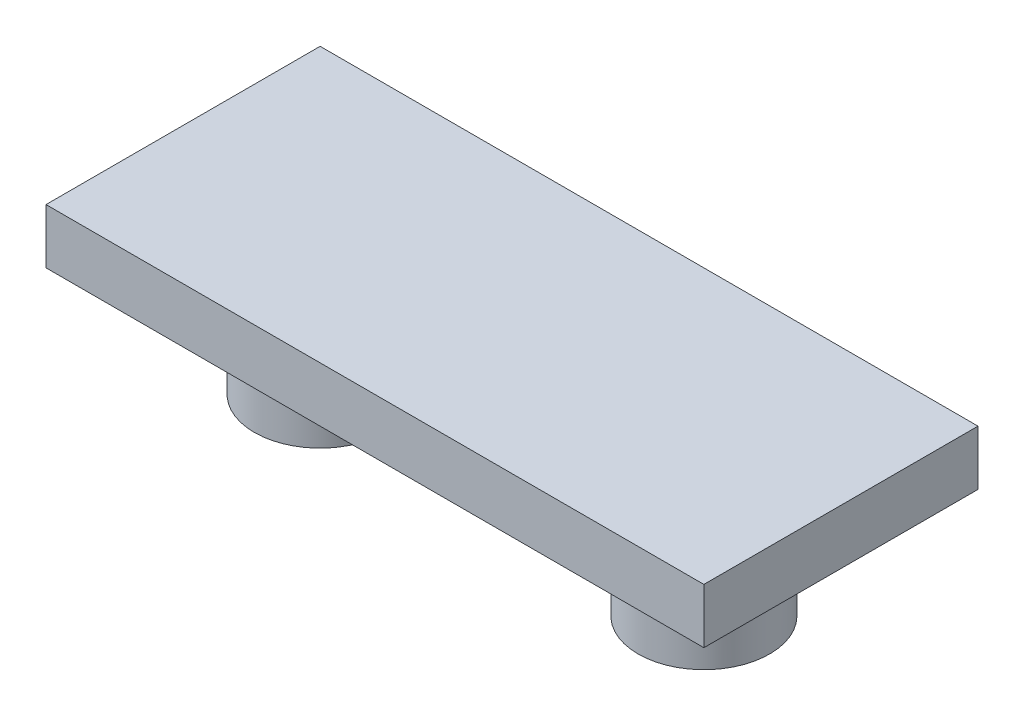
from build123d import *

# Parameters (mm, degrees)
BASESK_W          = 120
BASESK_H          = 50
BASEBOSS_DEPTH    = 10
PILLARASK_R       = 12
PILLARABOSS_DEPTH = 30
PILLARBSK_R       = 12
PILLARBBOSS_DEPTH = 30


with BuildPart() as part:
    # BaseSk → BaseBoss (new body)
    with BuildSketch(Plane(origin=(0, 0, 0), x_dir=(1, 0, 0), z_dir=(0, 1, 0))):
        with Locations((60, 25)):
            Rectangle(BASESK_W, BASESK_H)
    extrude(amount=-BASEBOSS_DEPTH)

    # PillarASk → PillarABoss (add)
    with BuildSketch(Plane(origin=(0, 0, 0), x_dir=(1, 0, 0), z_dir=(0, 1, 0))):
        with Locations(Location((25, 25, 0), (0, 0, 270))):
            Circle(PILLARASK_R)
    extrude(amount=-PILLARABOSS_DEPTH)

    # PillarBSk → PillarBBoss (add)
    with BuildSketch(Plane(origin=(0, 0, 0), x_dir=(1, 0, 0), z_dir=(0, 1, 0))):
        with Locations(Location((95, 25, 0), (0, 0, 270))):
            Circle(PILLARBSK_R)
    extrude(amount=-PILLARBBOSS_DEPTH)


solid = part.part
